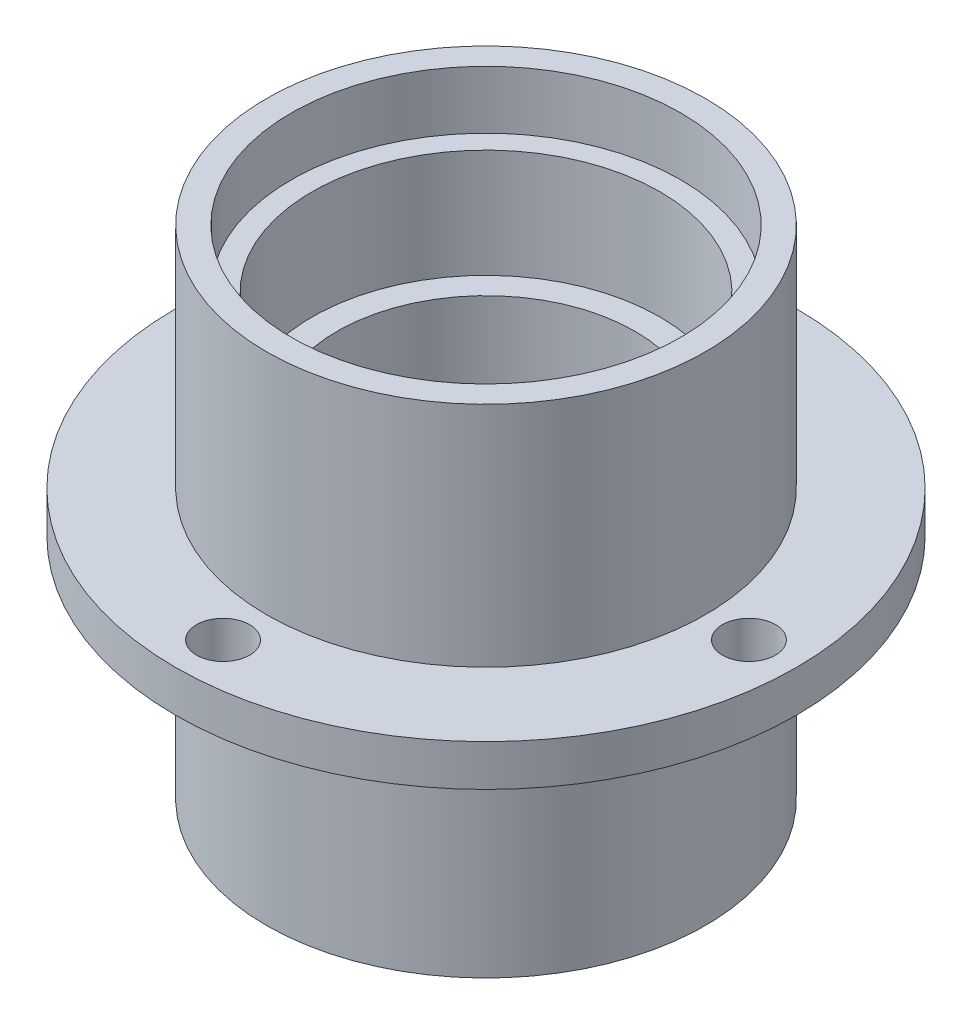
from build123d import *

# Parameters (mm, degrees)
ESQUISSE2_R      = 3.2
EXTRUSION1_DEPTH = 10


with BuildPart() as part:
    # Esquisse1 → R_volution1 (revolve)
    with BuildSketch(Plane(origin=(0, 0, 0), x_dir=(0, 0, -1), z_dir=(1, 0, 0))):
        Polygon((23.5, 60.1), (23.5, 53.1), (21, 53.1), (21, 40), (18, 40), (18, 20), (21, 20), (21, 7), (23.5, 7), (23.5, 0), (26.5, 0.1), (26.5, 27.6), (37.5, 27.6), (37.5, 32.6), (26.5, 32.6), (26.5, 60.1), align=None)
    revolve(axis=Axis((0, -13.214822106, 0), (0, 1, 0)))

    # Esquisse2 → Extrusion1 (cut)
    with BuildSketch(Plane(origin=(0, 32.6, 0), x_dir=(-1, 0, 0), z_dir=(0, 1, 0))):
        with Locations(Location((-31.75, 0, 0), (0, 0, 90))):
            Circle(ESQUISSE2_R)
        with Locations(Location((0, 31.75, 0), (0, 0, 90))):
            Circle(ESQUISSE2_R)
        with Locations(Location((31.75, 0, 0), (0, 0, 90))):
            Circle(ESQUISSE2_R)
        with Locations(Location((0, -31.75, 0), (0, 0, 90))):
            Circle(ESQUISSE2_R)
    extrude(amount=-EXTRUSION1_DEPTH, mode=Mode.SUBTRACT)


solid = part.part
